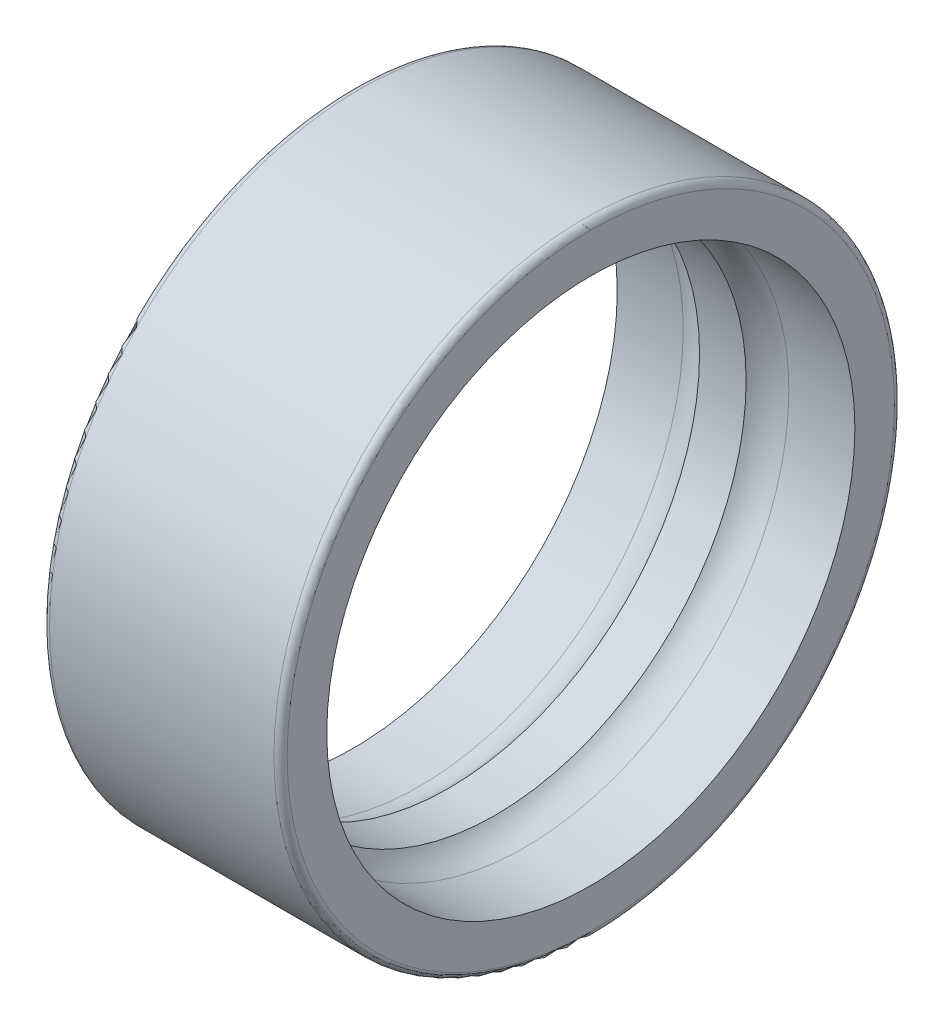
from build123d import *

# Parameters (mm, degrees)
CONG_1_R = 0.5


with BuildPart() as part:
    # Esquisse1 → R_volution1 (revolve)
    with BuildSketch(Plane.XY, mode=Mode.PRIVATE) as r_volution1_sk:
        with BuildLine():
            Line((0, 20), (0, 23.5))
            Line((0, 23.5), (18, 23.5))
            Line((18, 23.5), (18, 20))
            Line((18, 20), (13, 20))
            ThreePointArc((13, 20), (11.775255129, 19.738612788), (10.763932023, 19))
            Line((10.763932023, 19), (7.236067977, 19))
            ThreePointArc((7.236067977, 19), (6.224744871, 19.738612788), (5, 20))
            Line((5, 20), (0, 20))
        make_face()
    revolve(r_volution1_sk.sketch.rotate(Axis((-1.439550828, 0, 0), (1, 0, 0)), 90), axis=Axis((-1.439550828, 0, 0), (1, 0, 0)))

    # Cong_1
    cong_1_edges = [part.edges().sort_by_distance(p)[0] for p in [
        (18, 0, -23.5),
        (0, 0, -23.5),
    ]]
    fillet(cong_1_edges, radius=CONG_1_R)


solid = part.part
